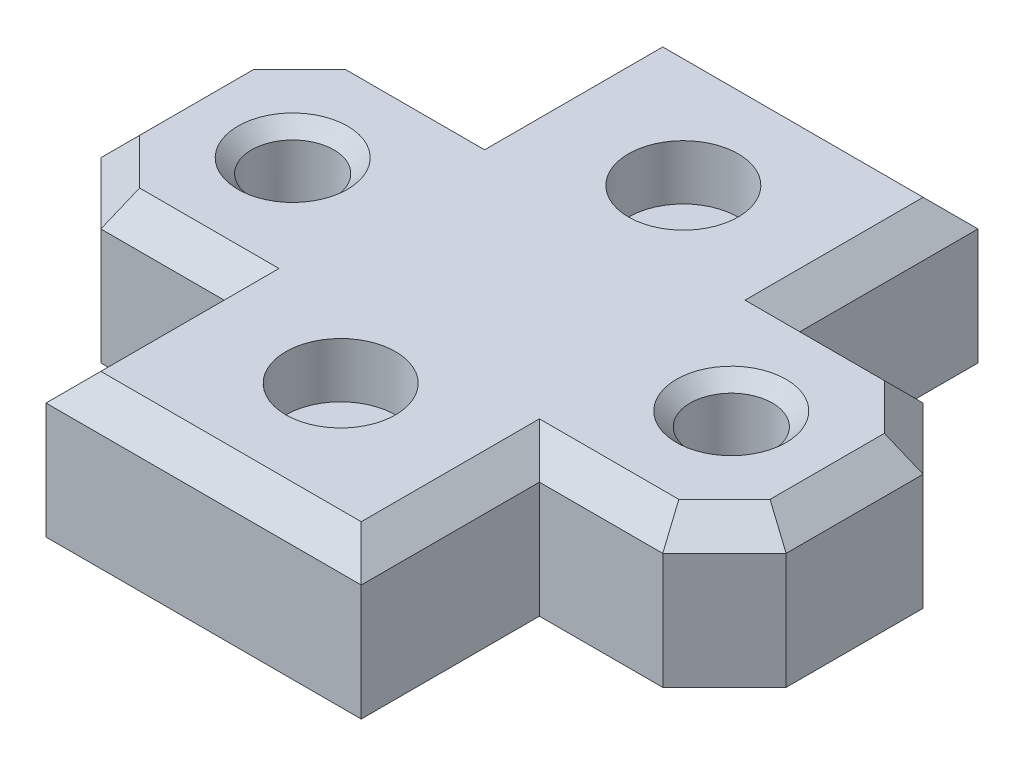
ISO-10303-21;
HEADER;
FILE_DESCRIPTION(('STEP AP214'),'2;1');
FILE_NAME('part.step','',(''),(''),'','','');
FILE_SCHEMA(('AUTOMOTIVE_DESIGN { 1 0 10303 214 1 1 1 1 }'));
ENDSEC;
DATA;
#1=APPLICATION_CONTEXT('core data for automotive mechanical design processes');
#2=APPLICATION_PROTOCOL_DEFINITION('international standard','automotive_design',2000,#1);
#3=PRODUCT_CONTEXT('',#1,'mechanical');
#4=PRODUCT('Part','Part','',(#3));
#5=PRODUCT_RELATED_PRODUCT_CATEGORY('part','',(#4));
#6=PRODUCT_DEFINITION_FORMATION('','',#4);
#7=PRODUCT_DEFINITION_CONTEXT('part definition',#1,'design');
#8=PRODUCT_DEFINITION('design','',#6,#7);
#9=PRODUCT_DEFINITION_SHAPE('','',#8);
#10=(LENGTH_UNIT() NAMED_UNIT(*) SI_UNIT(.MILLI.,.METRE.));
#11=(NAMED_UNIT(*) PLANE_ANGLE_UNIT() SI_UNIT($,.RADIAN.));
#12=(NAMED_UNIT(*) SI_UNIT($,.STERADIAN.) SOLID_ANGLE_UNIT());
#13=UNCERTAINTY_MEASURE_WITH_UNIT(LENGTH_MEASURE(1.E-05),#10,'distance_accuracy_value','');
#14=(GEOMETRIC_REPRESENTATION_CONTEXT(3) GLOBAL_UNCERTAINTY_ASSIGNED_CONTEXT((#13)) GLOBAL_UNIT_ASSIGNED_CONTEXT((#10,
#11,#12)) REPRESENTATION_CONTEXT('',''));
#15=CARTESIAN_POINT('',(0.,0.,0.));
#16=DIRECTION('',(0.,0.,1.));
#17=DIRECTION('',(1.,0.,0.));
#18=AXIS2_PLACEMENT_3D('',#15,#16,#17);
#19=CARTESIAN_POINT('',(11.5,10.47,-9.50000000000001));
#20=DIRECTION('',(0.,0.,1.));
#21=DIRECTION('',(1.,0.,0.));
#22=AXIS2_PLACEMENT_3D('',#19,#20,#21);
#23=PLANE('',#22);
#24=DIRECTION('',(0.,-1.,0.));
#25=VECTOR('',#24,1.);
#26=CARTESIAN_POINT('',(11.5,10.47,-9.50000000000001));
#27=LINE('',#26,#25);
#28=CARTESIAN_POINT('',(11.5,8.47,-9.50000000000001));
#29=VERTEX_POINT('',#28);
#30=CARTESIAN_POINT('',(11.5,0.,-9.50000000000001));
#31=VERTEX_POINT('',#30);
#32=EDGE_CURVE('E192',#29,#31,#27,.T.);
#33=ORIENTED_EDGE('',*,*,#32,.F.);
#34=DIRECTION('',(1.,0.,0.));
#35=VECTOR('',#34,1.);
#36=CARTESIAN_POINT('',(11.5,8.47,-9.50000000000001));
#37=LINE('',#36,#35);
#38=CARTESIAN_POINT('',(20.5,8.47,-9.50000000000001));
#39=VERTEX_POINT('',#38);
#40=EDGE_CURVE('E352',#29,#39,#37,.T.);
#41=ORIENTED_EDGE('',*,*,#40,.T.);
#42=DIRECTION('',(0.,-1.,0.));
#43=VECTOR('',#42,1.);
#44=CARTESIAN_POINT('',(20.5,10.47,-9.50000000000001));
#45=LINE('',#44,#43);
#46=CARTESIAN_POINT('',(20.5,0.,-9.50000000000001));
#47=VERTEX_POINT('',#46);
#48=EDGE_CURVE('E213',#39,#47,#45,.T.);
#49=ORIENTED_EDGE('',*,*,#48,.T.);
#50=DIRECTION('',(-1.,0.,0.));
#51=VECTOR('',#50,1.);
#52=CARTESIAN_POINT('',(11.5,0.,-9.50000000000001));
#53=LINE('',#52,#51);
#54=EDGE_CURVE('E207',#47,#31,#53,.T.);
#55=ORIENTED_EDGE('',*,*,#54,.T.);
#56=EDGE_LOOP('',(#33,#41,#49,#55));
#57=FACE_BOUND('',#56,.T.);
#58=ADVANCED_FACE('F32',(#57),#23,.F.);
#59=CARTESIAN_POINT('',(11.5,10.47,-22.5));
#60=DIRECTION('',(-1.,0.,0.));
#61=DIRECTION('',(0.,0.,1.));
#62=AXIS2_PLACEMENT_3D('',#59,#60,#61);
#63=PLANE('',#62);
#64=DIRECTION('',(0.,-1.,0.));
#65=VECTOR('',#64,1.);
#66=CARTESIAN_POINT('',(11.5,10.47,-22.5));
#67=LINE('',#66,#65);
#68=CARTESIAN_POINT('',(11.5,8.47,-22.5));
#69=VERTEX_POINT('',#68);
#70=CARTESIAN_POINT('',(11.5,0.,-22.5));
#71=VERTEX_POINT('',#70);
#72=EDGE_CURVE('E201',#69,#71,#67,.T.);
#73=ORIENTED_EDGE('',*,*,#72,.F.);
#74=DIRECTION('',(0.,0.,1.));
#75=VECTOR('',#74,1.);
#76=CARTESIAN_POINT('',(11.5,8.47,-22.5));
#77=LINE('',#76,#75);
#78=EDGE_CURVE('E47',#69,#29,#77,.T.);
#79=ORIENTED_EDGE('',*,*,#78,.T.);
#80=ORIENTED_EDGE('',*,*,#32,.T.);
#81=DIRECTION('',(0.,0.,-1.));
#82=VECTOR('',#81,1.);
#83=CARTESIAN_POINT('',(11.5,0.,-22.5));
#84=LINE('',#83,#82);
#85=EDGE_CURVE('E195',#31,#71,#84,.T.);
#86=ORIENTED_EDGE('',*,*,#85,.T.);
#87=EDGE_LOOP('',(#73,#79,#80,#86));
#88=FACE_BOUND('',#87,.T.);
#89=ADVANCED_FACE('F194',(#88),#63,.F.);
#90=CARTESIAN_POINT('',(11.5,10.47,-22.5));
#91=DIRECTION('',(0.,0.,1.));
#92=DIRECTION('',(1.,0.,0.));
#93=AXIS2_PLACEMENT_3D('',#90,#91,#92);
#94=PLANE('',#93);
#95=DIRECTION('',(0.,-1.,0.));
#96=VECTOR('',#95,1.);
#97=CARTESIAN_POINT('',(-11.5,10.47,-22.5));
#98=LINE('',#97,#96);
#99=CARTESIAN_POINT('',(-11.5,8.47,-22.5));
#100=VERTEX_POINT('',#99);
#101=CARTESIAN_POINT('',(-11.5,0.,-22.5));
#102=VERTEX_POINT('',#101);
#103=EDGE_CURVE('E288',#100,#102,#98,.T.);
#104=ORIENTED_EDGE('',*,*,#103,.F.);
#105=DIRECTION('',(1.,0.,0.));
#106=VECTOR('',#105,1.);
#107=CARTESIAN_POINT('',(11.5,8.47,-22.5));
#108=LINE('',#107,#106);
#109=EDGE_CURVE('E55',#100,#69,#108,.T.);
#110=ORIENTED_EDGE('',*,*,#109,.T.);
#111=ORIENTED_EDGE('',*,*,#72,.T.);
#112=DIRECTION('',(-1.,0.,0.));
#113=VECTOR('',#112,1.);
#114=CARTESIAN_POINT('',(11.5,0.,-22.5));
#115=LINE('',#114,#113);
#116=EDGE_CURVE('E210',#71,#102,#115,.T.);
#117=ORIENTED_EDGE('',*,*,#116,.T.);
#118=EDGE_LOOP('',(#104,#110,#111,#117));
#119=FACE_BOUND('',#118,.T.);
#120=ADVANCED_FACE('F472',(#119),#94,.F.);
#121=CARTESIAN_POINT('',(-11.5,10.47,-22.5));
#122=DIRECTION('',(1.,0.,0.));
#123=DIRECTION('',(0.,0.,-1.));
#124=AXIS2_PLACEMENT_3D('',#121,#122,#123);
#125=PLANE('',#124);
#126=DIRECTION('',(0.,-1.,0.));
#127=VECTOR('',#126,1.);
#128=CARTESIAN_POINT('',(-11.5,10.47,-9.50000000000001));
#129=LINE('',#128,#127);
#130=CARTESIAN_POINT('',(-11.5,8.47,-9.50000000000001));
#131=VERTEX_POINT('',#130);
#132=CARTESIAN_POINT('',(-11.5,0.,-9.50000000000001));
#133=VERTEX_POINT('',#132);
#134=EDGE_CURVE('E286',#131,#133,#129,.T.);
#135=ORIENTED_EDGE('',*,*,#134,.F.);
#136=DIRECTION('',(0.,0.,-1.));
#137=VECTOR('',#136,1.);
#138=CARTESIAN_POINT('',(-11.5,8.47,-22.5));
#139=LINE('',#138,#137);
#140=EDGE_CURVE('E348',#131,#100,#139,.T.);
#141=ORIENTED_EDGE('',*,*,#140,.T.);
#142=ORIENTED_EDGE('',*,*,#103,.T.);
#143=DIRECTION('',(0.,0.,1.));
#144=VECTOR('',#143,1.);
#145=CARTESIAN_POINT('',(-11.5,0.,-22.5));
#146=LINE('',#145,#144);
#147=EDGE_CURVE('E225',#102,#133,#146,.T.);
#148=ORIENTED_EDGE('',*,*,#147,.T.);
#149=EDGE_LOOP('',(#135,#141,#142,#148));
#150=FACE_BOUND('',#149,.T.);
#151=ADVANCED_FACE('F588',(#150),#125,.F.);
#152=CARTESIAN_POINT('',(-11.5,10.47,-9.50000000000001));
#153=DIRECTION('',(0.,0.,1.));
#154=DIRECTION('',(1.,0.,0.));
#155=AXIS2_PLACEMENT_3D('',#152,#153,#154);
#156=PLANE('',#155);
#157=DIRECTION('',(0.,-1.,0.));
#158=VECTOR('',#157,1.);
#159=CARTESIAN_POINT('',(-20.5,10.47,-9.50000000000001));
#160=LINE('',#159,#158);
#161=CARTESIAN_POINT('',(-20.5,8.47,-9.50000000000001));
#162=VERTEX_POINT('',#161);
#163=CARTESIAN_POINT('',(-20.5,0.,-9.50000000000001));
#164=VERTEX_POINT('',#163);
#165=EDGE_CURVE('E284',#162,#164,#160,.T.);
#166=ORIENTED_EDGE('',*,*,#165,.F.);
#167=DIRECTION('',(1.,0.,0.));
#168=VECTOR('',#167,1.);
#169=CARTESIAN_POINT('',(-11.5,8.47,-9.50000000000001));
#170=LINE('',#169,#168);
#171=EDGE_CURVE('E346',#162,#131,#170,.T.);
#172=ORIENTED_EDGE('',*,*,#171,.T.);
#173=ORIENTED_EDGE('',*,*,#134,.T.);
#174=DIRECTION('',(-1.,0.,0.));
#175=VECTOR('',#174,1.);
#176=CARTESIAN_POINT('',(-11.5,0.,-9.50000000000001));
#177=LINE('',#176,#175);
#178=EDGE_CURVE('E228',#133,#164,#177,.T.);
#179=ORIENTED_EDGE('',*,*,#178,.T.);
#180=EDGE_LOOP('',(#166,#172,#173,#179));
#181=FACE_BOUND('',#180,.T.);
#182=ADVANCED_FACE('F586',(#181),#156,.F.);
#183=CARTESIAN_POINT('',(-20.5,10.47,-9.50000000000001));
#184=DIRECTION('',(0.707106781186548,0.,0.707106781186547));
#185=DIRECTION('',(0.707106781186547,0.,-0.707106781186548));
#186=AXIS2_PLACEMENT_3D('',#183,#184,#185);
#187=PLANE('',#186);
#188=DIRECTION('',(0.,-1.,0.));
#189=VECTOR('',#188,1.);
#190=CARTESIAN_POINT('',(-25.,10.47,-5.00000000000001));
#191=LINE('',#190,#189);
#192=CARTESIAN_POINT('',(-25.,8.47,-5.00000000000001));
#193=VERTEX_POINT('',#192);
#194=CARTESIAN_POINT('',(-25.,0.,-5.00000000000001));
#195=VERTEX_POINT('',#194);
#196=EDGE_CURVE('E282',#193,#195,#191,.T.);
#197=ORIENTED_EDGE('',*,*,#196,.F.);
#198=DIRECTION('',(0.707106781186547,0.,-0.707106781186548));
#199=VECTOR('',#198,1.);
#200=CARTESIAN_POINT('',(-20.5,8.46999999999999,-9.50000000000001));
#201=LINE('',#200,#199);
#202=EDGE_CURVE('E344',#193,#162,#201,.T.);
#203=ORIENTED_EDGE('',*,*,#202,.T.);
#204=ORIENTED_EDGE('',*,*,#165,.T.);
#205=DIRECTION('',(-0.707106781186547,0.,0.707106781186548));
#206=VECTOR('',#205,1.);
#207=CARTESIAN_POINT('',(-20.5,0.,-9.50000000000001));
#208=LINE('',#207,#206);
#209=EDGE_CURVE('E231',#164,#195,#208,.T.);
#210=ORIENTED_EDGE('',*,*,#209,.T.);
#211=EDGE_LOOP('',(#197,#203,#204,#210));
#212=FACE_BOUND('',#211,.T.);
#213=ADVANCED_FACE('F555',(#212),#187,.F.);
#214=CARTESIAN_POINT('',(-25.,10.47,-5.00000000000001));
#215=DIRECTION('',(1.,0.,0.));
#216=DIRECTION('',(0.,0.,-1.));
#217=AXIS2_PLACEMENT_3D('',#214,#215,#216);
#218=PLANE('',#217);
#219=DIRECTION('',(0.,-1.,0.));
#220=VECTOR('',#219,1.);
#221=CARTESIAN_POINT('',(-25.,10.47,4.99999999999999));
#222=LINE('',#221,#220);
#223=CARTESIAN_POINT('',(-25.,8.47,4.99999999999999));
#224=VERTEX_POINT('',#223);
#225=CARTESIAN_POINT('',(-25.,0.,4.99999999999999));
#226=VERTEX_POINT('',#225);
#227=EDGE_CURVE('E280',#224,#226,#222,.T.);
#228=ORIENTED_EDGE('',*,*,#227,.F.);
#229=DIRECTION('',(0.,0.,-1.));
#230=VECTOR('',#229,1.);
#231=CARTESIAN_POINT('',(-25.,8.47,-5.00000000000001));
#232=LINE('',#231,#230);
#233=EDGE_CURVE('E342',#224,#193,#232,.T.);
#234=ORIENTED_EDGE('',*,*,#233,.T.);
#235=ORIENTED_EDGE('',*,*,#196,.T.);
#236=DIRECTION('',(0.,0.,1.));
#237=VECTOR('',#236,1.);
#238=CARTESIAN_POINT('',(-25.,0.,-5.00000000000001));
#239=LINE('',#238,#237);
#240=EDGE_CURVE('E234',#195,#226,#239,.T.);
#241=ORIENTED_EDGE('',*,*,#240,.T.);
#242=EDGE_LOOP('',(#228,#234,#235,#241));
#243=FACE_BOUND('',#242,.T.);
#244=ADVANCED_FACE('F553',(#243),#218,.F.);
#245=CARTESIAN_POINT('',(-25.,10.47,4.99999999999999));
#246=DIRECTION('',(0.707106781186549,0.,-0.707106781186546));
#247=DIRECTION('',(-0.707106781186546,0.,-0.707106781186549));
#248=AXIS2_PLACEMENT_3D('',#245,#246,#247);
#249=PLANE('',#248);
#250=DIRECTION('',(0.,-1.,0.));
#251=VECTOR('',#250,1.);
#252=CARTESIAN_POINT('',(-20.5,10.47,9.5));
#253=LINE('',#252,#251);
#254=CARTESIAN_POINT('',(-20.5,8.47,9.5));
#255=VERTEX_POINT('',#254);
#256=CARTESIAN_POINT('',(-20.5,0.,9.5));
#257=VERTEX_POINT('',#256);
#258=EDGE_CURVE('E278',#255,#257,#253,.T.);
#259=ORIENTED_EDGE('',*,*,#258,.F.);
#260=DIRECTION('',(-0.707106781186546,0.,-0.707106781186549));
#261=VECTOR('',#260,1.);
#262=CARTESIAN_POINT('',(-25.,8.47,4.99999999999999));
#263=LINE('',#262,#261);
#264=EDGE_CURVE('E340',#255,#224,#263,.T.);
#265=ORIENTED_EDGE('',*,*,#264,.T.);
#266=ORIENTED_EDGE('',*,*,#227,.T.);
#267=DIRECTION('',(0.707106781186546,0.,0.707106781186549));
#268=VECTOR('',#267,1.);
#269=CARTESIAN_POINT('',(-25.,0.,4.99999999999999));
#270=LINE('',#269,#268);
#271=EDGE_CURVE('E237',#226,#257,#270,.T.);
#272=ORIENTED_EDGE('',*,*,#271,.T.);
#273=EDGE_LOOP('',(#259,#265,#266,#272));
#274=FACE_BOUND('',#273,.T.);
#275=ADVANCED_FACE('F565',(#274),#249,.F.);
#276=CARTESIAN_POINT('',(-20.5,10.47,9.5));
#277=DIRECTION('',(0.,0.,-1.));
#278=DIRECTION('',(-1.,0.,0.));
#279=AXIS2_PLACEMENT_3D('',#276,#277,#278);
#280=PLANE('',#279);
#281=DIRECTION('',(0.,-1.,0.));
#282=VECTOR('',#281,1.);
#283=CARTESIAN_POINT('',(-11.5,10.47,9.49999999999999));
#284=LINE('',#283,#282);
#285=CARTESIAN_POINT('',(-11.5,8.47,9.49999999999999));
#286=VERTEX_POINT('',#285);
#287=CARTESIAN_POINT('',(-11.5,0.,9.49999999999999));
#288=VERTEX_POINT('',#287);
#289=EDGE_CURVE('E276',#286,#288,#284,.T.);
#290=ORIENTED_EDGE('',*,*,#289,.F.);
#291=DIRECTION('',(-1.,0.,0.));
#292=VECTOR('',#291,1.);
#293=CARTESIAN_POINT('',(-20.5,8.47,9.5));
#294=LINE('',#293,#292);
#295=EDGE_CURVE('E338',#286,#255,#294,.T.);
#296=ORIENTED_EDGE('',*,*,#295,.T.);
#297=ORIENTED_EDGE('',*,*,#258,.T.);
#298=DIRECTION('',(1.,0.,0.));
#299=VECTOR('',#298,1.);
#300=CARTESIAN_POINT('',(-20.5,0.,9.5));
#301=LINE('',#300,#299);
#302=EDGE_CURVE('E240',#257,#288,#301,.T.);
#303=ORIENTED_EDGE('',*,*,#302,.T.);
#304=EDGE_LOOP('',(#290,#296,#297,#303));
#305=FACE_BOUND('',#304,.T.);
#306=ADVANCED_FACE('F568',(#305),#280,.F.);
#307=CARTESIAN_POINT('',(-11.5,10.47,9.49999999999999));
#308=DIRECTION('',(1.,0.,0.));
#309=DIRECTION('',(0.,0.,-1.));
#310=AXIS2_PLACEMENT_3D('',#307,#308,#309);
#311=PLANE('',#310);
#312=DIRECTION('',(0.,-1.,0.));
#313=VECTOR('',#312,1.);
#314=CARTESIAN_POINT('',(-11.5,10.47,22.5));
#315=LINE('',#314,#313);
#316=CARTESIAN_POINT('',(-11.5,8.47,22.5));
#317=VERTEX_POINT('',#316);
#318=CARTESIAN_POINT('',(-11.5,0.,22.5));
#319=VERTEX_POINT('',#318);
#320=EDGE_CURVE('E274',#317,#319,#315,.T.);
#321=ORIENTED_EDGE('',*,*,#320,.F.);
#322=DIRECTION('',(0.,0.,-1.));
#323=VECTOR('',#322,1.);
#324=CARTESIAN_POINT('',(-11.5,8.47,9.49999999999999));
#325=LINE('',#324,#323);
#326=EDGE_CURVE('E336',#317,#286,#325,.T.);
#327=ORIENTED_EDGE('',*,*,#326,.T.);
#328=ORIENTED_EDGE('',*,*,#289,.T.);
#329=DIRECTION('',(0.,0.,1.));
#330=VECTOR('',#329,1.);
#331=CARTESIAN_POINT('',(-11.5,0.,9.49999999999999));
#332=LINE('',#331,#330);
#333=EDGE_CURVE('E243',#288,#319,#332,.T.);
#334=ORIENTED_EDGE('',*,*,#333,.T.);
#335=EDGE_LOOP('',(#321,#327,#328,#334));
#336=FACE_BOUND('',#335,.T.);
#337=ADVANCED_FACE('F633',(#336),#311,.F.);
#338=CARTESIAN_POINT('',(-11.5,10.47,22.5));
#339=DIRECTION('',(0.,0.,-1.));
#340=DIRECTION('',(-1.,0.,0.));
#341=AXIS2_PLACEMENT_3D('',#338,#339,#340);
#342=PLANE('',#341);
#343=DIRECTION('',(0.,-1.,0.));
#344=VECTOR('',#343,1.);
#345=CARTESIAN_POINT('',(11.5,10.47,22.5));
#346=LINE('',#345,#344);
#347=CARTESIAN_POINT('',(11.5,8.47,22.5));
#348=VERTEX_POINT('',#347);
#349=CARTESIAN_POINT('',(11.5,0.,22.5));
#350=VERTEX_POINT('',#349);
#351=EDGE_CURVE('E272',#348,#350,#346,.T.);
#352=ORIENTED_EDGE('',*,*,#351,.F.);
#353=DIRECTION('',(-1.,0.,0.));
#354=VECTOR('',#353,1.);
#355=CARTESIAN_POINT('',(-11.5,8.47,22.5));
#356=LINE('',#355,#354);
#357=EDGE_CURVE('E334',#348,#317,#356,.T.);
#358=ORIENTED_EDGE('',*,*,#357,.T.);
#359=ORIENTED_EDGE('',*,*,#320,.T.);
#360=DIRECTION('',(1.,0.,0.));
#361=VECTOR('',#360,1.);
#362=CARTESIAN_POINT('',(-11.5,0.,22.5));
#363=LINE('',#362,#361);
#364=EDGE_CURVE('E246',#319,#350,#363,.T.);
#365=ORIENTED_EDGE('',*,*,#364,.T.);
#366=EDGE_LOOP('',(#352,#358,#359,#365));
#367=FACE_BOUND('',#366,.T.);
#368=ADVANCED_FACE('F631',(#367),#342,.F.);
#369=CARTESIAN_POINT('',(11.5,10.47,9.49999999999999));
#370=DIRECTION('',(-1.,0.,0.));
#371=DIRECTION('',(0.,0.,1.));
#372=AXIS2_PLACEMENT_3D('',#369,#370,#371);
#373=PLANE('',#372);
#374=DIRECTION('',(0.,-1.,0.));
#375=VECTOR('',#374,1.);
#376=CARTESIAN_POINT('',(11.5,10.47,9.49999999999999));
#377=LINE('',#376,#375);
#378=CARTESIAN_POINT('',(11.5,8.47,9.49999999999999));
#379=VERTEX_POINT('',#378);
#380=CARTESIAN_POINT('',(11.5,0.,9.49999999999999));
#381=VERTEX_POINT('',#380);
#382=EDGE_CURVE('E270',#379,#381,#377,.T.);
#383=ORIENTED_EDGE('',*,*,#382,.F.);
#384=DIRECTION('',(0.,0.,1.));
#385=VECTOR('',#384,1.);
#386=CARTESIAN_POINT('',(11.5,8.47,9.49999999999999));
#387=LINE('',#386,#385);
#388=EDGE_CURVE('E332',#379,#348,#387,.T.);
#389=ORIENTED_EDGE('',*,*,#388,.T.);
#390=ORIENTED_EDGE('',*,*,#351,.T.);
#391=DIRECTION('',(0.,0.,-1.));
#392=VECTOR('',#391,1.);
#393=CARTESIAN_POINT('',(11.5,0.,9.49999999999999));
#394=LINE('',#393,#392);
#395=EDGE_CURVE('E249',#350,#381,#394,.T.);
#396=ORIENTED_EDGE('',*,*,#395,.T.);
#397=EDGE_LOOP('',(#383,#389,#390,#396));
#398=FACE_BOUND('',#397,.T.);
#399=ADVANCED_FACE('F623',(#398),#373,.F.);
#400=CARTESIAN_POINT('',(20.5,10.47,9.49999999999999));
#401=DIRECTION('',(0.,0.,-1.));
#402=DIRECTION('',(-1.,0.,0.));
#403=AXIS2_PLACEMENT_3D('',#400,#401,#402);
#404=PLANE('',#403);
#405=DIRECTION('',(0.,-1.,0.));
#406=VECTOR('',#405,1.);
#407=CARTESIAN_POINT('',(20.5,10.47,9.49999999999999));
#408=LINE('',#407,#406);
#409=CARTESIAN_POINT('',(20.5,8.47,9.49999999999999));
#410=VERTEX_POINT('',#409);
#411=CARTESIAN_POINT('',(20.5,0.,9.49999999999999));
#412=VERTEX_POINT('',#411);
#413=EDGE_CURVE('E268',#410,#412,#408,.T.);
#414=ORIENTED_EDGE('',*,*,#413,.F.);
#415=DIRECTION('',(-1.,0.,0.));
#416=VECTOR('',#415,1.);
#417=CARTESIAN_POINT('',(20.5,8.47,9.49999999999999));
#418=LINE('',#417,#416);
#419=EDGE_CURVE('E330',#410,#379,#418,.T.);
#420=ORIENTED_EDGE('',*,*,#419,.T.);
#421=ORIENTED_EDGE('',*,*,#382,.T.);
#422=DIRECTION('',(1.,0.,0.));
#423=VECTOR('',#422,1.);
#424=CARTESIAN_POINT('',(20.5,0.,9.49999999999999));
#425=LINE('',#424,#423);
#426=EDGE_CURVE('E252',#381,#412,#425,.T.);
#427=ORIENTED_EDGE('',*,*,#426,.T.);
#428=EDGE_LOOP('',(#414,#420,#421,#427));
#429=FACE_BOUND('',#428,.T.);
#430=ADVANCED_FACE('F620',(#429),#404,.F.);
#431=CARTESIAN_POINT('',(25.,10.47,4.99999999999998));
#432=DIRECTION('',(-0.707106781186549,0.,-0.707106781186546));
#433=DIRECTION('',(-0.707106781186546,0.,0.707106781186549));
#434=AXIS2_PLACEMENT_3D('',#431,#432,#433);
#435=PLANE('',#434);
#436=DIRECTION('',(0.,-1.,0.));
#437=VECTOR('',#436,1.);
#438=CARTESIAN_POINT('',(25.,10.47,4.99999999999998));
#439=LINE('',#438,#437);
#440=CARTESIAN_POINT('',(25.,8.47,4.99999999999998));
#441=VERTEX_POINT('',#440);
#442=CARTESIAN_POINT('',(25.,0.,4.99999999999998));
#443=VERTEX_POINT('',#442);
#444=EDGE_CURVE('E266',#441,#443,#439,.T.);
#445=ORIENTED_EDGE('',*,*,#444,.F.);
#446=DIRECTION('',(-0.707106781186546,0.,0.707106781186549));
#447=VECTOR('',#446,1.);
#448=CARTESIAN_POINT('',(25.,8.47,4.99999999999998));
#449=LINE('',#448,#447);
#450=EDGE_CURVE('E328',#441,#410,#449,.T.);
#451=ORIENTED_EDGE('',*,*,#450,.T.);
#452=ORIENTED_EDGE('',*,*,#413,.T.);
#453=DIRECTION('',(0.707106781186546,0.,-0.707106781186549));
#454=VECTOR('',#453,1.);
#455=CARTESIAN_POINT('',(25.,0.,4.99999999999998));
#456=LINE('',#455,#454);
#457=EDGE_CURVE('E255',#412,#443,#456,.T.);
#458=ORIENTED_EDGE('',*,*,#457,.T.);
#459=EDGE_LOOP('',(#445,#451,#452,#458));
#460=FACE_BOUND('',#459,.T.);
#461=ADVANCED_FACE('F609',(#460),#435,.F.);
#462=CARTESIAN_POINT('',(25.,10.47,-5.00000000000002));
#463=DIRECTION('',(-1.,0.,0.));
#464=DIRECTION('',(0.,0.,1.));
#465=AXIS2_PLACEMENT_3D('',#462,#463,#464);
#466=PLANE('',#465);
#467=DIRECTION('',(0.,-1.,0.));
#468=VECTOR('',#467,1.);
#469=CARTESIAN_POINT('',(25.,10.47,-5.00000000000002));
#470=LINE('',#469,#468);
#471=CARTESIAN_POINT('',(25.,8.47,-5.00000000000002));
#472=VERTEX_POINT('',#471);
#473=CARTESIAN_POINT('',(25.,0.,-5.00000000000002));
#474=VERTEX_POINT('',#473);
#475=EDGE_CURVE('E264',#472,#474,#470,.T.);
#476=ORIENTED_EDGE('',*,*,#475,.F.);
#477=DIRECTION('',(0.,0.,1.));
#478=VECTOR('',#477,1.);
#479=CARTESIAN_POINT('',(25.,8.47,-5.00000000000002));
#480=LINE('',#479,#478);
#481=EDGE_CURVE('E326',#472,#441,#480,.T.);
#482=ORIENTED_EDGE('',*,*,#481,.T.);
#483=ORIENTED_EDGE('',*,*,#444,.T.);
#484=DIRECTION('',(0.,0.,-1.));
#485=VECTOR('',#484,1.);
#486=CARTESIAN_POINT('',(25.,0.,-5.00000000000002));
#487=LINE('',#486,#485);
#488=EDGE_CURVE('E258',#443,#474,#487,.T.);
#489=ORIENTED_EDGE('',*,*,#488,.T.);
#490=EDGE_LOOP('',(#476,#482,#483,#489));
#491=FACE_BOUND('',#490,.T.);
#492=ADVANCED_FACE('F606',(#491),#466,.F.);
#493=CARTESIAN_POINT('',(20.5,10.47,-9.50000000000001));
#494=DIRECTION('',(-0.707106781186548,0.,0.707106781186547));
#495=DIRECTION('',(0.707106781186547,0.,0.707106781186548));
#496=AXIS2_PLACEMENT_3D('',#493,#494,#495);
#497=PLANE('',#496);
#498=ORIENTED_EDGE('',*,*,#48,.F.);
#499=DIRECTION('',(0.707106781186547,0.,0.707106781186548));
#500=VECTOR('',#499,1.);
#501=CARTESIAN_POINT('',(20.5,8.47,-9.50000000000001));
#502=LINE('',#501,#500);
#503=EDGE_CURVE('E323',#39,#472,#502,.T.);
#504=ORIENTED_EDGE('',*,*,#503,.T.);
#505=ORIENTED_EDGE('',*,*,#475,.T.);
#506=DIRECTION('',(-0.707106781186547,0.,-0.707106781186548));
#507=VECTOR('',#506,1.);
#508=CARTESIAN_POINT('',(20.5,0.,-9.50000000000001));
#509=LINE('',#508,#507);
#510=EDGE_CURVE('E261',#474,#47,#509,.T.);
#511=ORIENTED_EDGE('',*,*,#510,.T.);
#512=EDGE_LOOP('',(#498,#504,#505,#511));
#513=FACE_BOUND('',#512,.T.);
#514=ADVANCED_FACE('F450',(#513),#497,.F.);
#515=CARTESIAN_POINT('',(25.,10.47,-9.50000000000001));
#516=DIRECTION('',(0.,-1.,0.));
#517=DIRECTION('',(0.,0.,-1.));
#518=AXIS2_PLACEMENT_3D('',#515,#516,#517);
#519=PLANE('',#518);
#520=CARTESIAN_POINT('',(0.,10.47,-12.5));
#521=DIRECTION('',(0.,1.,0.));
#522=DIRECTION('',(0.,0.,1.));
#523=AXIS2_PLACEMENT_3D('',#520,#521,#522);
#524=CIRCLE('',#523,4.);
#525=CARTESIAN_POINT('',(0.,10.47,-8.50000000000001));
#526=VERTEX_POINT('',#525);
#527=EDGE_CURVE('E433',#526,#526,#524,.T.);
#528=ORIENTED_EDGE('',*,*,#527,.F.);
#529=EDGE_LOOP('',(#528));
#530=FACE_BOUND('',#529,.T.);
#531=CARTESIAN_POINT('',(0.,10.47,12.5));
#532=DIRECTION('',(0.,1.,0.));
#533=DIRECTION('',(0.,0.,1.));
#534=AXIS2_PLACEMENT_3D('',#531,#532,#533);
#535=CIRCLE('',#534,4.);
#536=CARTESIAN_POINT('',(0.,10.47,16.5));
#537=VERTEX_POINT('',#536);
#538=EDGE_CURVE('E427',#537,#537,#535,.T.);
#539=ORIENTED_EDGE('',*,*,#538,.F.);
#540=EDGE_LOOP('',(#539));
#541=FACE_BOUND('',#540,.T.);
#542=CARTESIAN_POINT('',(16.,10.47,0.));
#543=DIRECTION('',(0.,-1.,0.));
#544=DIRECTION('',(0.,0.,-1.));
#545=AXIS2_PLACEMENT_3D('',#542,#543,#544);
#546=CIRCLE('',#545,4.);
#547=CARTESIAN_POINT('',(16.,10.47,-4.));
#548=VERTEX_POINT('',#547);
#549=EDGE_CURVE('E40',#548,#548,#546,.T.);
#550=ORIENTED_EDGE('',*,*,#549,.T.);
#551=EDGE_LOOP('',(#550));
#552=FACE_BOUND('',#551,.T.);
#553=CARTESIAN_POINT('',(-16.,10.47,0.));
#554=DIRECTION('',(0.,-1.,0.));
#555=DIRECTION('',(0.,0.,-1.));
#556=AXIS2_PLACEMENT_3D('',#553,#554,#555);
#557=CIRCLE('',#556,4.);
#558=CARTESIAN_POINT('',(-16.,10.47,-4.));
#559=VERTEX_POINT('',#558);
#560=EDGE_CURVE('E399',#559,#559,#557,.T.);
#561=ORIENTED_EDGE('',*,*,#560,.T.);
#562=EDGE_LOOP('',(#561));
#563=FACE_BOUND('',#562,.T.);
#564=DIRECTION('',(0.,0.,-1.));
#565=VECTOR('',#564,1.);
#566=CARTESIAN_POINT('',(23.,10.47,-9.50000000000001));
#567=LINE('',#566,#565);
#568=CARTESIAN_POINT('',(23.,10.47,4.17157287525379));
#569=VERTEX_POINT('',#568);
#570=CARTESIAN_POINT('',(23.,10.47,-4.17157287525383));
#571=VERTEX_POINT('',#570);
#572=EDGE_CURVE('E318',#569,#571,#567,.T.);
#573=ORIENTED_EDGE('',*,*,#572,.T.);
#574=DIRECTION('',(-0.707106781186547,0.,-0.707106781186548));
#575=VECTOR('',#574,1.);
#576=CARTESIAN_POINT('',(21.3357864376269,10.47,-5.83578643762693));
#577=LINE('',#576,#575);
#578=CARTESIAN_POINT('',(19.6715728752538,10.47,-7.50000000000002));
#579=VERTEX_POINT('',#578);
#580=EDGE_CURVE('E320',#571,#579,#577,.T.);
#581=ORIENTED_EDGE('',*,*,#580,.T.);
#582=DIRECTION('',(-1.,0.,0.));
#583=VECTOR('',#582,1.);
#584=CARTESIAN_POINT('',(25.,10.47,-7.50000000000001));
#585=LINE('',#584,#583);
#586=CARTESIAN_POINT('',(9.50000000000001,10.47,-7.50000000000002));
#587=VERTEX_POINT('',#586);
#588=EDGE_CURVE('E200',#579,#587,#585,.T.);
#589=ORIENTED_EDGE('',*,*,#588,.T.);
#590=DIRECTION('',(0.,0.,-1.));
#591=VECTOR('',#590,1.);
#592=CARTESIAN_POINT('',(9.50000000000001,10.47,-9.50000000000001));
#593=LINE('',#592,#591);
#594=CARTESIAN_POINT('',(9.50000000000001,10.47,-20.5));
#595=VERTEX_POINT('',#594);
#596=EDGE_CURVE('E292',#587,#595,#593,.T.);
#597=ORIENTED_EDGE('',*,*,#596,.T.);
#598=DIRECTION('',(-1.,0.,0.));
#599=VECTOR('',#598,1.);
#600=CARTESIAN_POINT('',(25.,10.47,-20.5));
#601=LINE('',#600,#599);
#602=CARTESIAN_POINT('',(-9.5,10.47,-20.5));
#603=VERTEX_POINT('',#602);
#604=EDGE_CURVE('E294',#595,#603,#601,.T.);
#605=ORIENTED_EDGE('',*,*,#604,.T.);
#606=DIRECTION('',(0.,0.,1.));
#607=VECTOR('',#606,1.);
#608=CARTESIAN_POINT('',(-9.5,10.47,-9.50000000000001));
#609=LINE('',#608,#607);
#610=CARTESIAN_POINT('',(-9.5,10.47,-7.50000000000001));
#611=VERTEX_POINT('',#610);
#612=EDGE_CURVE('E296',#603,#611,#609,.T.);
#613=ORIENTED_EDGE('',*,*,#612,.T.);
#614=DIRECTION('',(-1.,0.,0.));
#615=VECTOR('',#614,1.);
#616=CARTESIAN_POINT('',(25.,10.47,-7.50000000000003));
#617=LINE('',#616,#615);
#618=CARTESIAN_POINT('',(-19.6715728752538,10.47,-7.50000000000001));
#619=VERTEX_POINT('',#618);
#620=EDGE_CURVE('E298',#611,#619,#617,.T.);
#621=ORIENTED_EDGE('',*,*,#620,.T.);
#622=DIRECTION('',(-0.707106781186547,0.,0.707106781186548));
#623=VECTOR('',#622,1.);
#624=CARTESIAN_POINT('',(3.66421356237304,10.47,-30.8357864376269));
#625=LINE('',#624,#623);
#626=CARTESIAN_POINT('',(-23.,10.47,-4.17157287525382));
#627=VERTEX_POINT('',#626);
#628=EDGE_CURVE('E300',#619,#627,#625,.T.);
#629=ORIENTED_EDGE('',*,*,#628,.T.);
#630=DIRECTION('',(0.,0.,1.));
#631=VECTOR('',#630,1.);
#632=CARTESIAN_POINT('',(-23.,10.47,-9.50000000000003));
#633=LINE('',#632,#631);
#634=CARTESIAN_POINT('',(-23.,10.47,4.1715728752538));
#635=VERTEX_POINT('',#634);
#636=EDGE_CURVE('E302',#627,#635,#633,.T.);
#637=ORIENTED_EDGE('',*,*,#636,.T.);
#638=DIRECTION('',(0.707106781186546,0.,0.707106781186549));
#639=VECTOR('',#638,1.);
#640=CARTESIAN_POINT('',(-5.83578643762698,10.47,21.3357864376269));
#641=LINE('',#640,#639);
#642=CARTESIAN_POINT('',(-19.6715728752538,10.47,7.5));
#643=VERTEX_POINT('',#642);
#644=EDGE_CURVE('E304',#635,#643,#641,.T.);
#645=ORIENTED_EDGE('',*,*,#644,.T.);
#646=DIRECTION('',(1.,0.,0.));
#647=VECTOR('',#646,1.);
#648=CARTESIAN_POINT('',(25.,10.47,7.49999999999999));
#649=LINE('',#648,#647);
#650=CARTESIAN_POINT('',(-9.49999999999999,10.47,7.5));
#651=VERTEX_POINT('',#650);
#652=EDGE_CURVE('E306',#643,#651,#649,.T.);
#653=ORIENTED_EDGE('',*,*,#652,.T.);
#654=DIRECTION('',(0.,0.,1.));
#655=VECTOR('',#654,1.);
#656=CARTESIAN_POINT('',(-9.5,10.47,-9.50000000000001));
#657=LINE('',#656,#655);
#658=CARTESIAN_POINT('',(-9.49999999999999,10.47,20.5));
#659=VERTEX_POINT('',#658);
#660=EDGE_CURVE('E308',#651,#659,#657,.T.);
#661=ORIENTED_EDGE('',*,*,#660,.T.);
#662=DIRECTION('',(1.,0.,0.));
#663=VECTOR('',#662,1.);
#664=CARTESIAN_POINT('',(25.,10.47,20.5));
#665=LINE('',#664,#663);
#666=CARTESIAN_POINT('',(9.50000000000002,10.47,20.5));
#667=VERTEX_POINT('',#666);
#668=EDGE_CURVE('E310',#659,#667,#665,.T.);
#669=ORIENTED_EDGE('',*,*,#668,.T.);
#670=DIRECTION('',(0.,0.,-1.));
#671=VECTOR('',#670,1.);
#672=CARTESIAN_POINT('',(9.50000000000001,10.47,-9.50000000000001));
#673=LINE('',#672,#671);
#674=CARTESIAN_POINT('',(9.50000000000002,10.47,7.5));
#675=VERTEX_POINT('',#674);
#676=EDGE_CURVE('E312',#667,#675,#673,.T.);
#677=ORIENTED_EDGE('',*,*,#676,.T.);
#678=DIRECTION('',(1.,0.,0.));
#679=VECTOR('',#678,1.);
#680=CARTESIAN_POINT('',(25.,10.47,7.5));
#681=LINE('',#680,#679);
#682=CARTESIAN_POINT('',(19.6715728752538,10.47,7.5));
#683=VERTEX_POINT('',#682);
#684=EDGE_CURVE('E314',#675,#683,#681,.T.);
#685=ORIENTED_EDGE('',*,*,#684,.T.);
#686=DIRECTION('',(0.707106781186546,0.,-0.707106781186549));
#687=VECTOR('',#686,1.);
#688=CARTESIAN_POINT('',(30.8357864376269,10.47,-3.66421356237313));
#689=LINE('',#688,#687);
#690=EDGE_CURVE('E316',#683,#569,#689,.T.);
#691=ORIENTED_EDGE('',*,*,#690,.T.);
#692=EDGE_LOOP('',(#573,#581,#589,#597,#605,#613,#621,#629,#637,#645,#653,#661,#669,#677,#685,#691));
#693=FACE_BOUND('',#692,.T.);
#694=ADVANCED_FACE('F404',(#530,#541,#552,#563,#693),#519,.F.);
#695=CARTESIAN_POINT('',(25.,0.,-9.50000000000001));
#696=DIRECTION('',(0.,-1.,0.));
#697=DIRECTION('',(0.,0.,-1.));
#698=AXIS2_PLACEMENT_3D('',#695,#696,#697);
#699=PLANE('',#698);
#700=CARTESIAN_POINT('',(-16.,0.,0.));
#701=DIRECTION('',(0.,1.,0.));
#702=DIRECTION('',(0.,0.,1.));
#703=AXIS2_PLACEMENT_3D('',#700,#701,#702);
#704=CIRCLE('',#703,3.);
#705=CARTESIAN_POINT('',(-16.,0.,3.));
#706=VERTEX_POINT('',#705);
#707=EDGE_CURVE('E421',#706,#706,#704,.T.);
#708=ORIENTED_EDGE('',*,*,#707,.T.);
#709=EDGE_LOOP('',(#708));
#710=FACE_BOUND('',#709,.T.);
#711=CARTESIAN_POINT('',(16.,0.,0.));
#712=DIRECTION('',(0.,1.,0.));
#713=DIRECTION('',(0.,0.,1.));
#714=AXIS2_PLACEMENT_3D('',#711,#712,#713);
#715=CIRCLE('',#714,3.);
#716=CARTESIAN_POINT('',(16.,0.,3.));
#717=VERTEX_POINT('',#716);
#718=EDGE_CURVE('E221',#717,#717,#715,.T.);
#719=ORIENTED_EDGE('',*,*,#718,.T.);
#720=EDGE_LOOP('',(#719));
#721=FACE_BOUND('',#720,.T.);
#722=ORIENTED_EDGE('',*,*,#54,.F.);
#723=ORIENTED_EDGE('',*,*,#510,.F.);
#724=ORIENTED_EDGE('',*,*,#488,.F.);
#725=ORIENTED_EDGE('',*,*,#457,.F.);
#726=ORIENTED_EDGE('',*,*,#426,.F.);
#727=ORIENTED_EDGE('',*,*,#395,.F.);
#728=ORIENTED_EDGE('',*,*,#364,.F.);
#729=ORIENTED_EDGE('',*,*,#333,.F.);
#730=ORIENTED_EDGE('',*,*,#302,.F.);
#731=ORIENTED_EDGE('',*,*,#271,.F.);
#732=ORIENTED_EDGE('',*,*,#240,.F.);
#733=ORIENTED_EDGE('',*,*,#209,.F.);
#734=ORIENTED_EDGE('',*,*,#178,.F.);
#735=ORIENTED_EDGE('',*,*,#147,.F.);
#736=ORIENTED_EDGE('',*,*,#116,.F.);
#737=ORIENTED_EDGE('',*,*,#85,.F.);
#738=EDGE_LOOP('',(#722,#723,#724,#725,#726,#727,#728,#729,#730,#731,#732,#733,#734,#735,#736,#737));
#739=FACE_BOUND('',#738,.T.);
#740=ADVANCED_FACE('F205',(#710,#721,#739),#699,.T.);
#741=CARTESIAN_POINT('',(-5.83578643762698,10.47,21.3357864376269));
#742=DIRECTION('',(0.500000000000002,-0.707106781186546,-0.5));
#743=DIRECTION('',(0.816496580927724,0.577350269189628,0.));
#744=AXIS2_PLACEMENT_3D('',#741,#742,#743);
#745=PLANE('',#744);
#746=DIRECTION('',(0.678598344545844,0.678598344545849,-0.281084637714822));
#747=VECTOR('',#746,1.);
#748=CARTESIAN_POINT('',(-20.3922353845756,13.0777646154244,3.09140140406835));
#749=LINE('',#748,#747);
#750=EDGE_CURVE('E218',#224,#635,#749,.T.);
#751=ORIENTED_EDGE('',*,*,#750,.F.);
#752=ORIENTED_EDGE('',*,*,#264,.F.);
#753=DIRECTION('',(0.28108463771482,0.678598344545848,-0.678598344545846));
#754=VECTOR('',#753,1.);
#755=CARTESIAN_POINT('',(-21.2175144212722,6.73776695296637,11.2322330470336));
#756=LINE('',#755,#754);
#757=EDGE_CURVE('E215',#643,#255,#756,.F.);
#758=ORIENTED_EDGE('',*,*,#757,.F.);
#759=ORIENTED_EDGE('',*,*,#644,.F.);
#760=EDGE_LOOP('',(#751,#752,#758,#759));
#761=FACE_BOUND('',#760,.T.);
#762=ADVANCED_FACE('F534',(#761),#745,.F.);
#763=CARTESIAN_POINT('',(25.,10.47,7.49999999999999));
#764=DIRECTION('',(0.,-0.707106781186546,-0.707106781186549));
#765=DIRECTION('',(0.,0.707106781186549,-0.707106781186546));
#766=AXIS2_PLACEMENT_3D('',#763,#764,#765);
#767=PLANE('',#766);
#768=ORIENTED_EDGE('',*,*,#757,.T.);
#769=ORIENTED_EDGE('',*,*,#295,.F.);
#770=DIRECTION('',(0.577350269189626,0.577350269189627,-0.577350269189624));
#771=VECTOR('',#770,1.);
#772=CARTESIAN_POINT('',(-3.83333333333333,16.1366666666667,1.83333333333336));
#773=LINE('',#772,#771);
#774=EDGE_CURVE('E392',#651,#286,#773,.F.);
#775=ORIENTED_EDGE('',*,*,#774,.F.);
#776=ORIENTED_EDGE('',*,*,#652,.F.);
#777=EDGE_LOOP('',(#768,#769,#775,#776));
#778=FACE_BOUND('',#777,.T.);
#779=ADVANCED_FACE('F530',(#778),#767,.F.);
#780=CARTESIAN_POINT('',(-23.,10.47,-9.50000000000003));
#781=DIRECTION('',(0.70710678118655,-0.707106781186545,0.));
#782=DIRECTION('',(0.707106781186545,0.70710678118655,0.));
#783=AXIS2_PLACEMENT_3D('',#780,#781,#782);
#784=PLANE('',#783);
#785=ORIENTED_EDGE('',*,*,#750,.T.);
#786=ORIENTED_EDGE('',*,*,#636,.F.);
#787=DIRECTION('',(0.678598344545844,0.678598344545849,0.281084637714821));
#788=VECTOR('',#787,1.);
#789=CARTESIAN_POINT('',(-15.8072712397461,17.6627287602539,-1.19224707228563));
#790=LINE('',#789,#788);
#791=EDGE_CURVE('E389',#193,#627,#790,.T.);
#792=ORIENTED_EDGE('',*,*,#791,.F.);
#793=ORIENTED_EDGE('',*,*,#233,.F.);
#794=EDGE_LOOP('',(#785,#786,#792,#793));
#795=FACE_BOUND('',#794,.T.);
#796=ADVANCED_FACE('F526',(#795),#784,.F.);
#797=CARTESIAN_POINT('',(-9.49999999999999,10.47,-9.50000000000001));
#798=DIRECTION('',(0.707106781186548,-0.707106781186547,0.));
#799=DIRECTION('',(0.707106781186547,0.707106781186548,0.));
#800=AXIS2_PLACEMENT_3D('',#797,#798,#799);
#801=PLANE('',#800);
#802=ORIENTED_EDGE('',*,*,#774,.T.);
#803=ORIENTED_EDGE('',*,*,#326,.F.);
#804=DIRECTION('',(0.577350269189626,0.577350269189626,-0.577350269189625));
#805=VECTOR('',#804,1.);
#806=CARTESIAN_POINT('',(0.5,20.47,10.5));
#807=LINE('',#806,#805);
#808=EDGE_CURVE('E386',#659,#317,#807,.F.);
#809=ORIENTED_EDGE('',*,*,#808,.F.);
#810=ORIENTED_EDGE('',*,*,#660,.F.);
#811=EDGE_LOOP('',(#802,#803,#809,#810));
#812=FACE_BOUND('',#811,.T.);
#813=ADVANCED_FACE('F522',(#812),#801,.F.);
#814=CARTESIAN_POINT('',(3.66421356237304,10.47,-30.8357864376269));
#815=DIRECTION('',(0.500000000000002,-0.707106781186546,0.500000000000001));
#816=DIRECTION('',(0.816496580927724,0.577350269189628,0.));
#817=AXIS2_PLACEMENT_3D('',#814,#815,#816);
#818=PLANE('',#817);
#819=ORIENTED_EDGE('',*,*,#791,.T.);
#820=ORIENTED_EDGE('',*,*,#628,.F.);
#821=DIRECTION('',(0.281084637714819,0.678598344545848,0.678598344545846));
#822=VECTOR('',#821,1.);
#823=CARTESIAN_POINT('',(-16.142135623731,18.9908152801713,1.02081528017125));
#824=LINE('',#823,#822);
#825=EDGE_CURVE('E383',#162,#619,#824,.T.);
#826=ORIENTED_EDGE('',*,*,#825,.F.);
#827=ORIENTED_EDGE('',*,*,#202,.F.);
#828=EDGE_LOOP('',(#819,#820,#826,#827));
#829=FACE_BOUND('',#828,.T.);
#830=ADVANCED_FACE('F518',(#829),#818,.F.);
#831=CARTESIAN_POINT('',(25.,10.47,20.5));
#832=DIRECTION('',(0.,-0.707106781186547,-0.707106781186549));
#833=DIRECTION('',(0.,0.707106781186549,-0.707106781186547));
#834=AXIS2_PLACEMENT_3D('',#831,#832,#833);
#835=PLANE('',#834);
#836=ORIENTED_EDGE('',*,*,#808,.T.);
#837=ORIENTED_EDGE('',*,*,#357,.F.);
#838=DIRECTION('',(-0.577350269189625,0.577350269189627,-0.577350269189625));
#839=VECTOR('',#838,1.);
#840=CARTESIAN_POINT('',(14.6666666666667,5.30333333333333,25.6666666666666));
#841=LINE('',#840,#839);
#842=EDGE_CURVE('E380',#667,#348,#841,.F.);
#843=ORIENTED_EDGE('',*,*,#842,.F.);
#844=ORIENTED_EDGE('',*,*,#668,.F.);
#845=EDGE_LOOP('',(#836,#837,#843,#844));
#846=FACE_BOUND('',#845,.T.);
#847=ADVANCED_FACE('F514',(#846),#835,.F.);
#848=CARTESIAN_POINT('',(25.,10.47,-7.50000000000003));
#849=DIRECTION('',(0.,-0.707106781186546,0.707106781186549));
#850=DIRECTION('',(0.,-0.707106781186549,-0.707106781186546));
#851=AXIS2_PLACEMENT_3D('',#848,#849,#850);
#852=PLANE('',#851);
#853=ORIENTED_EDGE('',*,*,#825,.T.);
#854=ORIENTED_EDGE('',*,*,#620,.F.);
#855=DIRECTION('',(0.577350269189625,0.577350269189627,0.577350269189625));
#856=VECTOR('',#855,1.);
#857=CARTESIAN_POINT('',(1.99999999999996,21.97,3.99999999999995));
#858=LINE('',#857,#856);
#859=EDGE_CURVE('E377',#131,#611,#858,.T.);
#860=ORIENTED_EDGE('',*,*,#859,.F.);
#861=ORIENTED_EDGE('',*,*,#171,.F.);
#862=EDGE_LOOP('',(#853,#854,#860,#861));
#863=FACE_BOUND('',#862,.T.);
#864=ADVANCED_FACE('F510',(#863),#852,.F.);
#865=CARTESIAN_POINT('',(9.50000000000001,10.47,-9.50000000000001));
#866=DIRECTION('',(-0.707106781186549,-0.707106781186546,0.));
#867=DIRECTION('',(0.707106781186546,-0.707106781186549,0.));
#868=AXIS2_PLACEMENT_3D('',#865,#866,#867);
#869=PLANE('',#868);
#870=ORIENTED_EDGE('',*,*,#842,.T.);
#871=ORIENTED_EDGE('',*,*,#388,.F.);
#872=DIRECTION('',(-0.577350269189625,0.577350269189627,-0.577350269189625));
#873=VECTOR('',#872,1.);
#874=CARTESIAN_POINT('',(14.6666666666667,5.30333333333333,12.6666666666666));
#875=LINE('',#874,#873);
#876=EDGE_CURVE('E374',#675,#379,#875,.F.);
#877=ORIENTED_EDGE('',*,*,#876,.F.);
#878=ORIENTED_EDGE('',*,*,#676,.F.);
#879=EDGE_LOOP('',(#870,#871,#877,#878));
#880=FACE_BOUND('',#879,.T.);
#881=ADVANCED_FACE('F506',(#880),#869,.F.);
#882=CARTESIAN_POINT('',(-9.5,10.47,-9.50000000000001));
#883=DIRECTION('',(0.707106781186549,-0.707106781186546,0.));
#884=DIRECTION('',(0.707106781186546,0.707106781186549,0.));
#885=AXIS2_PLACEMENT_3D('',#882,#883,#884);
#886=PLANE('',#885);
#887=ORIENTED_EDGE('',*,*,#859,.T.);
#888=ORIENTED_EDGE('',*,*,#612,.F.);
#889=DIRECTION('',(0.577350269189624,0.577350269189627,0.577350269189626));
#890=VECTOR('',#889,1.);
#891=CARTESIAN_POINT('',(1.99999999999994,21.97,-9.00000000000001));
#892=LINE('',#891,#890);
#893=EDGE_CURVE('E371',#100,#603,#892,.T.);
#894=ORIENTED_EDGE('',*,*,#893,.F.);
#895=ORIENTED_EDGE('',*,*,#140,.F.);
#896=EDGE_LOOP('',(#887,#888,#894,#895));
#897=FACE_BOUND('',#896,.T.);
#898=ADVANCED_FACE('F502',(#897),#886,.F.);
#899=CARTESIAN_POINT('',(25.,10.47,7.5));
#900=DIRECTION('',(0.,-0.707106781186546,-0.707106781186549));
#901=DIRECTION('',(0.,0.707106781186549,-0.707106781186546));
#902=AXIS2_PLACEMENT_3D('',#899,#900,#901);
#903=PLANE('',#902);
#904=ORIENTED_EDGE('',*,*,#876,.T.);
#905=ORIENTED_EDGE('',*,*,#419,.F.);
#906=DIRECTION('',(-0.28108463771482,0.678598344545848,-0.678598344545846));
#907=VECTOR('',#906,1.);
#908=CARTESIAN_POINT('',(20.0925643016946,9.453636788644,8.516363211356));
#909=LINE('',#908,#907);
#910=EDGE_CURVE('E368',#683,#410,#909,.F.);
#911=ORIENTED_EDGE('',*,*,#910,.F.);
#912=ORIENTED_EDGE('',*,*,#684,.F.);
#913=EDGE_LOOP('',(#904,#905,#911,#912));
#914=FACE_BOUND('',#913,.T.);
#915=ADVANCED_FACE('F498',(#914),#903,.F.);
#916=CARTESIAN_POINT('',(25.,10.47,-20.5));
#917=DIRECTION('',(0.,-0.707106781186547,0.707106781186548));
#918=DIRECTION('',(0.,-0.707106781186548,-0.707106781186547));
#919=AXIS2_PLACEMENT_3D('',#916,#917,#918);
#920=PLANE('',#919);
#921=ORIENTED_EDGE('',*,*,#893,.T.);
#922=ORIENTED_EDGE('',*,*,#604,.F.);
#923=DIRECTION('',(-0.577350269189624,0.577350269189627,0.577350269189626));
#924=VECTOR('',#923,1.);
#925=CARTESIAN_POINT('',(5.83333333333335,14.1366666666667,-16.8333333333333));
#926=LINE('',#925,#924);
#927=EDGE_CURVE('E365',#69,#595,#926,.T.);
#928=ORIENTED_EDGE('',*,*,#927,.F.);
#929=ORIENTED_EDGE('',*,*,#109,.F.);
#930=EDGE_LOOP('',(#921,#922,#928,#929));
#931=FACE_BOUND('',#930,.T.);
#932=ADVANCED_FACE('F494',(#931),#920,.F.);
#933=CARTESIAN_POINT('',(30.8357864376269,10.47,-3.66421356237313));
#934=DIRECTION('',(-0.500000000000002,-0.707106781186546,-0.5));
#935=DIRECTION('',(0.816496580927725,-0.577350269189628,0.));
#936=AXIS2_PLACEMENT_3D('',#933,#934,#935);
#937=PLANE('',#936);
#938=ORIENTED_EDGE('',*,*,#910,.T.);
#939=ORIENTED_EDGE('',*,*,#450,.F.);
#940=DIRECTION('',(-0.678598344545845,0.678598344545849,-0.281084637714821));
#941=VECTOR('',#940,1.);
#942=CARTESIAN_POINT('',(25.1137201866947,8.3562798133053,5.04710444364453));
#943=LINE('',#942,#941);
#944=EDGE_CURVE('E362',#569,#441,#943,.F.);
#945=ORIENTED_EDGE('',*,*,#944,.F.);
#946=ORIENTED_EDGE('',*,*,#690,.F.);
#947=EDGE_LOOP('',(#938,#939,#945,#946));
#948=FACE_BOUND('',#947,.T.);
#949=ADVANCED_FACE('F490',(#948),#937,.F.);
#950=CARTESIAN_POINT('',(9.50000000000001,10.47,-9.50000000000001));
#951=DIRECTION('',(-0.707106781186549,-0.707106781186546,0.));
#952=DIRECTION('',(0.707106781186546,-0.707106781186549,0.));
#953=AXIS2_PLACEMENT_3D('',#950,#951,#952);
#954=PLANE('',#953);
#955=ORIENTED_EDGE('',*,*,#927,.T.);
#956=ORIENTED_EDGE('',*,*,#596,.F.);
#957=DIRECTION('',(-0.577350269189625,0.577350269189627,0.577350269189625));
#958=VECTOR('',#957,1.);
#959=CARTESIAN_POINT('',(10.1666666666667,9.80333333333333,-8.16666666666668));
#960=LINE('',#959,#958);
#961=EDGE_CURVE('E359',#29,#587,#960,.T.);
#962=ORIENTED_EDGE('',*,*,#961,.F.);
#963=ORIENTED_EDGE('',*,*,#78,.F.);
#964=EDGE_LOOP('',(#955,#956,#962,#963));
#965=FACE_BOUND('',#964,.T.);
#966=ADVANCED_FACE('F486',(#965),#954,.F.);
#967=CARTESIAN_POINT('',(23.,10.47,-9.50000000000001));
#968=DIRECTION('',(-0.70710678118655,-0.707106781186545,0.));
#969=DIRECTION('',(0.707106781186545,-0.70710678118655,0.));
#970=AXIS2_PLACEMENT_3D('',#967,#968,#969);
#971=PLANE('',#970);
#972=ORIENTED_EDGE('',*,*,#944,.T.);
#973=ORIENTED_EDGE('',*,*,#481,.F.);
#974=DIRECTION('',(-0.678598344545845,0.678598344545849,0.281084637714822));
#975=VECTOR('',#974,1.);
#976=CARTESIAN_POINT('',(24.016363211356,9.45363678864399,-4.59256430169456));
#977=LINE('',#976,#975);
#978=EDGE_CURVE('E357',#571,#472,#977,.F.);
#979=ORIENTED_EDGE('',*,*,#978,.F.);
#980=ORIENTED_EDGE('',*,*,#572,.F.);
#981=EDGE_LOOP('',(#972,#973,#979,#980));
#982=FACE_BOUND('',#981,.T.);
#983=ADVANCED_FACE('F482',(#982),#971,.F.);
#984=CARTESIAN_POINT('',(25.,10.47,-7.50000000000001));
#985=DIRECTION('',(0.,-0.707106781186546,0.707106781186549));
#986=DIRECTION('',(0.,-0.707106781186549,-0.707106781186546));
#987=AXIS2_PLACEMENT_3D('',#984,#985,#986);
#988=PLANE('',#987);
#989=ORIENTED_EDGE('',*,*,#961,.T.);
#990=ORIENTED_EDGE('',*,*,#588,.F.);
#991=DIRECTION('',(0.281084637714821,-0.678598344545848,-0.678598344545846));
#992=VECTOR('',#991,1.);
#993=CARTESIAN_POINT('',(20.0925643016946,9.453636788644,-8.51636321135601));
#994=LINE('',#993,#992);
#995=EDGE_CURVE('E355',#39,#579,#994,.F.);
#996=ORIENTED_EDGE('',*,*,#995,.F.);
#997=ORIENTED_EDGE('',*,*,#40,.F.);
#998=EDGE_LOOP('',(#989,#990,#996,#997));
#999=FACE_BOUND('',#998,.T.);
#1000=ADVANCED_FACE('F478',(#999),#988,.F.);
#1001=CARTESIAN_POINT('',(21.3357864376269,10.47,-5.83578643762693));
#1002=DIRECTION('',(-0.500000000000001,-0.707106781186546,0.5));
#1003=DIRECTION('',(0.816496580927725,-0.577350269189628,0.));
#1004=AXIS2_PLACEMENT_3D('',#1001,#1002,#1003);
#1005=PLANE('',#1004);
#1006=ORIENTED_EDGE('',*,*,#978,.T.);
#1007=ORIENTED_EDGE('',*,*,#503,.F.);
#1008=ORIENTED_EDGE('',*,*,#995,.T.);
#1009=ORIENTED_EDGE('',*,*,#580,.F.);
#1010=EDGE_LOOP('',(#1006,#1007,#1008,#1009));
#1011=FACE_BOUND('',#1010,.T.);
#1012=ADVANCED_FACE('F416',(#1011),#1005,.F.);
#1013=CARTESIAN_POINT('',(16.,0.,0.));
#1014=DIRECTION('',(0.,1.,0.));
#1015=DIRECTION('',(0.,0.,1.));
#1016=AXIS2_PLACEMENT_3D('',#1013,#1014,#1015);
#1017=CYLINDRICAL_SURFACE('',#1016,3.);
#1018=CARTESIAN_POINT('',(16.,9.47,0.));
#1019=DIRECTION('',(0.,-1.,0.));
#1020=DIRECTION('',(0.,0.,-1.));
#1021=AXIS2_PLACEMENT_3D('',#1018,#1019,#1020);
#1022=CIRCLE('',#1021,3.);
#1023=CARTESIAN_POINT('',(16.,9.47,-3.));
#1024=VERTEX_POINT('',#1023);
#1025=EDGE_CURVE('E354',#1024,#1024,#1022,.F.);
#1026=ORIENTED_EDGE('',*,*,#1025,.T.);
#1027=EDGE_LOOP('',(#1026));
#1028=FACE_BOUND('',#1027,.T.);
#1029=ORIENTED_EDGE('',*,*,#718,.F.);
#1030=EDGE_LOOP('',(#1029));
#1031=FACE_BOUND('',#1030,.T.);
#1032=ADVANCED_FACE('F413',(#1028,#1031),#1017,.F.);
#1033=CARTESIAN_POINT('',(-16.,0.,0.));
#1034=DIRECTION('',(0.,1.,0.));
#1035=DIRECTION('',(0.,0.,1.));
#1036=AXIS2_PLACEMENT_3D('',#1033,#1034,#1035);
#1037=CYLINDRICAL_SURFACE('',#1036,3.);
#1038=CARTESIAN_POINT('',(-16.,9.47,0.));
#1039=DIRECTION('',(0.,-1.,0.));
#1040=DIRECTION('',(0.,0.,-1.));
#1041=AXIS2_PLACEMENT_3D('',#1038,#1039,#1040);
#1042=CIRCLE('',#1041,3.);
#1043=CARTESIAN_POINT('',(-16.,9.47,-3.));
#1044=VERTEX_POINT('',#1043);
#1045=EDGE_CURVE('E11',#1044,#1044,#1042,.F.);
#1046=ORIENTED_EDGE('',*,*,#1045,.T.);
#1047=EDGE_LOOP('',(#1046));
#1048=FACE_BOUND('',#1047,.T.);
#1049=ORIENTED_EDGE('',*,*,#707,.F.);
#1050=EDGE_LOOP('',(#1049));
#1051=FACE_BOUND('',#1050,.T.);
#1052=ADVANCED_FACE('F410',(#1048,#1051),#1037,.F.);
#1053=CARTESIAN_POINT('',(16.,9.47,0.));
#1054=DIRECTION('',(0.,1.,0.));
#1055=DIRECTION('',(0.,0.,1.));
#1056=AXIS2_PLACEMENT_3D('',#1053,#1054,#1055);
#1057=CONICAL_SURFACE('',#1056,3.,0.785398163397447);
#1058=ORIENTED_EDGE('',*,*,#549,.F.);
#1059=EDGE_LOOP('',(#1058));
#1060=FACE_BOUND('',#1059,.T.);
#1061=ORIENTED_EDGE('',*,*,#1025,.F.);
#1062=EDGE_LOOP('',(#1061));
#1063=FACE_BOUND('',#1062,.T.);
#1064=ADVANCED_FACE('F407',(#1060,#1063),#1057,.F.);
#1065=CARTESIAN_POINT('',(-16.,9.47,0.));
#1066=DIRECTION('',(0.,1.,0.));
#1067=DIRECTION('',(0.,0.,1.));
#1068=AXIS2_PLACEMENT_3D('',#1065,#1066,#1067);
#1069=CONICAL_SURFACE('',#1068,3.,0.785398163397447);
#1070=ORIENTED_EDGE('',*,*,#560,.F.);
#1071=EDGE_LOOP('',(#1070));
#1072=FACE_BOUND('',#1071,.T.);
#1073=ORIENTED_EDGE('',*,*,#1045,.F.);
#1074=EDGE_LOOP('',(#1073));
#1075=FACE_BOUND('',#1074,.T.);
#1076=ADVANCED_FACE('F34',(#1072,#1075),#1069,.F.);
#1077=CARTESIAN_POINT('',(0.,6.47,12.5));
#1078=DIRECTION('',(0.,1.,0.));
#1079=DIRECTION('',(0.,0.,1.));
#1080=AXIS2_PLACEMENT_3D('',#1077,#1078,#1079);
#1081=CYLINDRICAL_SURFACE('',#1080,4.);
#1082=CARTESIAN_POINT('',(0.,6.47,12.5));
#1083=DIRECTION('',(0.,1.,0.));
#1084=DIRECTION('',(0.,0.,1.));
#1085=AXIS2_PLACEMENT_3D('',#1082,#1083,#1084);
#1086=CIRCLE('',#1085,4.);
#1087=CARTESIAN_POINT('',(0.,6.47,16.5));
#1088=VERTEX_POINT('',#1087);
#1089=EDGE_CURVE('E423',#1088,#1088,#1086,.T.);
#1090=ORIENTED_EDGE('',*,*,#1089,.F.);
#1091=EDGE_LOOP('',(#1090));
#1092=FACE_BOUND('',#1091,.T.);
#1093=ORIENTED_EDGE('',*,*,#538,.T.);
#1094=EDGE_LOOP('',(#1093));
#1095=FACE_BOUND('',#1094,.T.);
#1096=ADVANCED_FACE('F454',(#1092,#1095),#1081,.F.);
#1097=CARTESIAN_POINT('',(0.,6.47,12.5));
#1098=DIRECTION('',(0.,1.,0.));
#1099=DIRECTION('',(0.,0.,1.));
#1100=AXIS2_PLACEMENT_3D('',#1097,#1098,#1099);
#1101=PLANE('',#1100);
#1102=ORIENTED_EDGE('',*,*,#1089,.T.);
#1103=EDGE_LOOP('',(#1102));
#1104=FACE_BOUND('',#1103,.T.);
#1105=ADVANCED_FACE('F444',(#1104),#1101,.T.);
#1106=CARTESIAN_POINT('',(0.,6.47,-12.5));
#1107=DIRECTION('',(0.,1.,0.));
#1108=DIRECTION('',(0.,0.,1.));
#1109=AXIS2_PLACEMENT_3D('',#1106,#1107,#1108);
#1110=CYLINDRICAL_SURFACE('',#1109,4.);
#1111=CARTESIAN_POINT('',(0.,6.47,-12.5));
#1112=DIRECTION('',(0.,1.,0.));
#1113=DIRECTION('',(0.,0.,1.));
#1114=AXIS2_PLACEMENT_3D('',#1111,#1112,#1113);
#1115=CIRCLE('',#1114,4.);
#1116=CARTESIAN_POINT('',(0.,6.47,-8.50000000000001));
#1117=VERTEX_POINT('',#1116);
#1118=EDGE_CURVE('E431',#1117,#1117,#1115,.T.);
#1119=ORIENTED_EDGE('',*,*,#1118,.F.);
#1120=EDGE_LOOP('',(#1119));
#1121=FACE_BOUND('',#1120,.T.);
#1122=ORIENTED_EDGE('',*,*,#527,.T.);
#1123=EDGE_LOOP('',(#1122));
#1124=FACE_BOUND('',#1123,.T.);
#1125=ADVANCED_FACE('F441',(#1121,#1124),#1110,.F.);
#1126=CARTESIAN_POINT('',(0.,6.47,-12.5));
#1127=DIRECTION('',(0.,1.,0.));
#1128=DIRECTION('',(0.,0.,1.));
#1129=AXIS2_PLACEMENT_3D('',#1126,#1127,#1128);
#1130=PLANE('',#1129);
#1131=ORIENTED_EDGE('',*,*,#1118,.T.);
#1132=EDGE_LOOP('',(#1131));
#1133=FACE_BOUND('',#1132,.T.);
#1134=ADVANCED_FACE('F439',(#1133),#1130,.T.);
#1135=CLOSED_SHELL('',(#58,#89,#120,#151,#182,#213,#244,#275,#306,#337,#368,#399,#430,#461,#492,
#514,#694,#740,#762,#779,#796,#813,#830,#847,#864,#881,#898,#915,#932,#949,#966,#983,#1000,
#1012,#1032,#1052,#1064,#1076,#1096,#1105,#1125,#1134));
#1136=MANIFOLD_SOLID_BREP('B2',#1135);
#1137=ADVANCED_BREP_SHAPE_REPRESENTATION('',(#18,#1136),#14);
#1138=SHAPE_DEFINITION_REPRESENTATION(#9,#1137);
ENDSEC;
END-ISO-10303-21;
